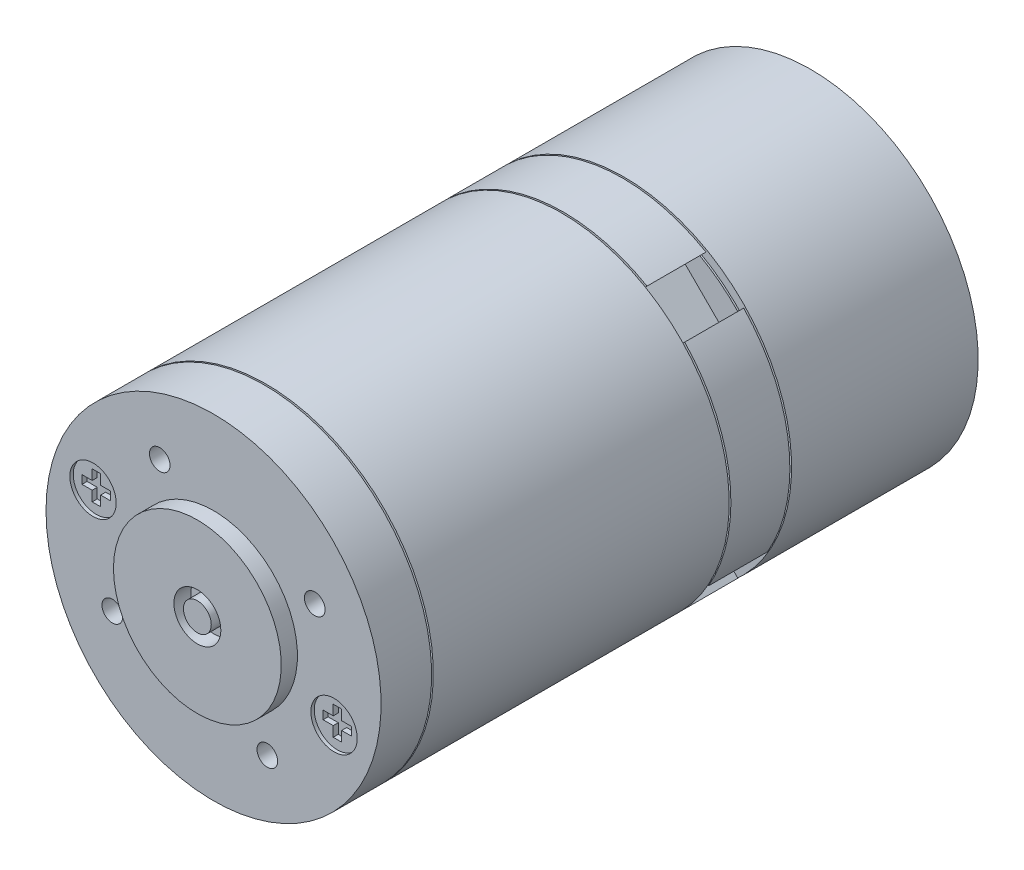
from build123d import *

# Parameters (mm, degrees)
SKETCH2_R                  = 3.7719
CUT_EXTRUDE1_DEPTH         = 6.35
SKETCH3_R                  = 3.175
BOSS_EXTRUDE1_DEPTH        = 6.35
FILLET1_R                  = 1.778
CUT_EXTRUDE2_DEPTH         = 1.27
SKETCH5_R                  = 4.953
SKETCH5_R_2                = 3.2385
CUT_EXTRUDE3_DEPTH         = 0.0254
SKETCH5_3_R                = 3.175
BOSS_EXTRUDE2_DEPTH        = 17.5006
CUT_EXTRUDE4_START         = -15.494
CUT_EXTRUDE4_DEPTH         = 15.494
SKETCH8_R                  = 3.53695
SKETCH8_R_2                = 2.0955
CUT_EXTRUDE6_DEPTH         = 2.54
SKETCH8_3_R                = 2.0955
BOSS_EXTRUDE3_DEPTH        = 5.08
SKETCH9_R                  = 1.55575
CUT_EXTRUDE7_DEPTH         = 6.35
SKETCH10_R                 = 3.4925
CUT_EXTRUDE8_DEPTH         = 0.508
SKETCH10_3_W               = 1.27
SKETCH10_3_H               = 1.524
SKETCH10_3_W_2             = 1.524
SKETCH10_3_H_2             = 1.27
SKETCH10_3_H_3             = 4.318
SKETCH10_3_W_3             = 4.318
CUT_EXTRUDE11_DEPTH        = 1.27
CUT_EXTRUDE12_DEPTH        = 8.89
F_10_32_TAPPED_HOLE1_D     = 4.0386
F_10_32_TAPPED_HOLE1_DEPTH = 24.0284
F_10_32_TAPPED_HOLE1_TIP   = 1.213317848


with BuildPart() as part:
    # Sketch1 → Revolve1 (revolve)
    with BuildSketch(Plane(origin=(0, 0, 0), x_dir=(0, 0, -1), z_dir=(1, 0, 0)), mode=Mode.PRIVATE) as revolve1_sk:
        Polygon((0, 0), (0, 12.64285), (2.4384, 12.64285), (2.4384, 25.2476), (10.0584, 25.2476), (10.0584, 23.9776), (10.3124, 23.9776), (10.3124, 25.2476), (54.9021, 25.2476), (54.9021, 23.9776), (55.1561, 23.9776), (55.1561, 25.2476), (64.0461, 25.2476), (64.0461, 23.9776), (64.3001, 23.9776), (64.3001, 25.2476), (92.4179, 25.2476), (92.4179, 14.2621), (94.0054, 14.2621), (94.0054, 0), align=None)
    revolve(revolve1_sk.sketch.rotate(Axis((0, 0, -94.0054), (0, 0, 1)), 90), axis=Axis((0, 0, -94.0054), (0, 0, 1)))

    # Sketch2 → Cut-Extrude1 (cut)
    with BuildSketch(Plane(origin=(0, 0, -92.4179), x_dir=(-1, 0, 0), z_dir=(0, 0, -1))):
        with Locations((0, 18.9865)):
            Circle(SKETCH2_R)
        with Locations((16.442791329, -9.49325)):
            Circle(SKETCH2_R)
        with Locations((-16.442791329, -9.49325)):
            Circle(SKETCH2_R)
    extrude(amount=-CUT_EXTRUDE1_DEPTH, mode=Mode.SUBTRACT)

    # Sketch3 → Boss-Extrude1 (add)
    with BuildSketch(Plane(origin=(0, 0, -89.8779), x_dir=(-1, 0, 0), z_dir=(0, 0, -1))):
        with Locations((0, 18.9865)):
            Circle(SKETCH3_R)
        with Locations((16.442791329, -9.49325)):
            Circle(SKETCH3_R)
        with Locations((-16.442791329, -9.49325)):
            Circle(SKETCH3_R)
    extrude(amount=-BOSS_EXTRUDE1_DEPTH)

    # Fillet1
    fillet1_edges = [part.edges().sort_by_distance(p)[0] for p in [
        (3.175, 18.9865, -89.8779),
        (-13.267791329, -9.49325, -89.8779),
        (19.617791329, -9.49325, -89.8779),
    ]]
    fillet(fillet1_edges, radius=FILLET1_R)

    # Sketch4 → Cut-Extrude2 (cut)
    with BuildSketch(Plane(origin=(0, 0, -89.8779), x_dir=(-1, 0, 0), z_dir=(0, 0, -1))):
        Polygon((0, 20.452969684), (-1.27, 19.719734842), (-1.27, 18.253265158), (0, 17.520030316), (1.27, 18.253265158), (1.27, 19.719734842), align=None)
        Polygon((16.442791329, -10.959719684), (17.712791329, -10.226484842), (17.712791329, -8.760015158), (16.442791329, -8.026780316), (15.172791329, -8.760015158), (15.172791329, -10.226484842), align=None)
        Polygon((-17.712791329, -8.760015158), (-17.712791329, -10.226484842), (-16.442791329, -10.959719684), (-15.172791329, -10.226484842), (-15.172791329, -8.760015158), (-16.442791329, -8.026780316), align=None)
    extrude(amount=-CUT_EXTRUDE2_DEPTH, mode=Mode.SUBTRACT)

    # Sketch5 → Cut-Extrude3 (cut)
    with BuildSketch(Plane(origin=(0, 0, -94.0054), x_dir=(-1, 0, 0), z_dir=(0, 0, -1))):
        with Locations((0, -8.3693)):
            Circle(SKETCH5_R)
        with Locations((0, -8.3693)):
            Circle(SKETCH5_R_2, mode=Mode.SUBTRACT)
    extrude(amount=-CUT_EXTRUDE3_DEPTH, mode=Mode.SUBTRACT)

    # Sketch5_3 → Boss-Extrude2 (add)
    with BuildSketch(Plane(origin=(0, 0, -94.0054), x_dir=(-1, 0, 0), z_dir=(0, 0, -1))):
        with Locations((0, -8.3693)):
            Circle(SKETCH5_3_R)
    extrude(amount=BOSS_EXTRUDE2_DEPTH)

    # Sketch6 → Cut-Extrude4 (cut)
    with BuildSketch(Plane(origin=(0, 0, -111.506), x_dir=(-1, 0, 0), z_dir=(0, 0, -1)).offset(CUT_EXTRUDE4_START)):
        with BuildLine():
            Line((-2.063505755, -5.9563), (2.063505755, -5.9563))
            ThreePointArc((2.063505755, -5.9563), (0, -5.1943), (-2.063505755, -5.9563))
        make_face()
    extrude(amount=CUT_EXTRUDE4_DEPTH, mode=Mode.SUBTRACT)

    # Sketch8 → Cut-Extrude6 (cut)
    # profile 1 of 2: a face of its own
    with BuildSketch(Plane.XY):
        Circle(SKETCH8_R)
        Circle(SKETCH8_R_2, mode=Mode.SUBTRACT)
    # profile 2 of 2: a face of its own
    with BuildSketch(Plane.XY):
        Circle(SKETCH8_R_2)
    extrude(amount=-CUT_EXTRUDE6_DEPTH, mode=Mode.SUBTRACT)

    # Sketch8_3 → Boss-Extrude3 (add)
    with BuildSketch(Plane.XY):
        Circle(SKETCH8_3_R)
    extrude(amount=-BOSS_EXTRUDE3_DEPTH)

    # Sketch9 → Cut-Extrude7 (cut)
    with BuildSketch(Plane.XY.offset(-2.4384)):
        with Locations((15.252477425, 8.104177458)):
            Circle(SKETCH9_R)
        with Locations((8.104177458, -15.252477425)):
            Circle(SKETCH9_R)
        with Locations((-15.252477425, -8.104177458)):
            Circle(SKETCH9_R)
        with Locations((-8.104177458, 15.252477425)):
            Circle(SKETCH9_R)
    extrude(amount=-CUT_EXTRUDE7_DEPTH, mode=Mode.SUBTRACT)

    # Sketch10 → Cut-Extrude8 (cut)
    with BuildSketch(Plane.XY.offset(-2.4384)):
        with Locations((-18.15997441, 6.279760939)):
            Circle(SKETCH10_R)
        with Locations((18.15997441, -6.279760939)):
            Circle(SKETCH10_R)
    extrude(amount=-CUT_EXTRUDE8_DEPTH, mode=Mode.SUBTRACT)

    # Sketch10_3 → Cut-Extrude11 (cut)
    with BuildSketch(Plane.XY.offset(-2.4384)):
        with Locations((18.15997441, -7.676760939)):
            Rectangle(SKETCH10_3_W, SKETCH10_3_H)
        with Locations((19.55697441, -6.279760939)):
            Rectangle(SKETCH10_3_W_2, SKETCH10_3_H_2)
        with Locations((18.15997441, -6.279760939)):
            Rectangle(SKETCH10_3_W, SKETCH10_3_H_2)
        with Locations((16.76297441, -6.279760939)):
            Rectangle(SKETCH10_3_W_2, SKETCH10_3_H_2)
        with Locations((18.15997441, -4.882760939)):
            Rectangle(SKETCH10_3_W, SKETCH10_3_H)
        with Locations((-18.15997441, 6.279760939)):
            Rectangle(SKETCH10_3_W, SKETCH10_3_H_3)
        with Locations((-18.15997441, 6.279760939)):
            Rectangle(SKETCH10_3_W_3, SKETCH10_3_H_2)
    extrude(amount=-CUT_EXTRUDE11_DEPTH, mode=Mode.SUBTRACT)

    # Sketch11 → Cut-Extrude12 (cut)
    with BuildSketch(Plane(origin=(0, 0, -64.0461), x_dir=(-1, 0, 0), z_dir=(0, 0, -1))):
        Polygon((17.866182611, 18.747137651), (13.663422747, 14.544377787), (18.737267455, 9.470533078), (22.94002732, 13.673292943), align=None)
        Polygon((14.544377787, -13.663422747), (9.470533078, -18.737267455), (13.673292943, -22.94002732), (18.747137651, -17.866182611), align=None)
        Polygon((-13.663422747, -14.544377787), (-18.737267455, -9.470533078), (-22.94002732, -13.673292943), (-17.866182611, -18.747137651), align=None)
        Polygon((-14.544377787, 13.663422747), (-9.470533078, 18.737267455), (-13.673292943, 22.94002732), (-18.747137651, 17.866182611), align=None)
    extrude(amount=-CUT_EXTRUDE12_DEPTH, mode=Mode.SUBTRACT)

    # 10-32 Tapped Hole1
    with Locations(Plane(origin=(0, 0, -92.4179), x_dir=(-1, 0, 0), z_dir=(0, 0, -1))):
        with Locations((19.08175, 0), (-19.08175, 0)):
            Hole(F_10_32_TAPPED_HOLE1_D / 2, depth=F_10_32_TAPPED_HOLE1_DEPTH)
            with Locations((0, 0, -(F_10_32_TAPPED_HOLE1_DEPTH + F_10_32_TAPPED_HOLE1_TIP / 2))):  # 118° drill point
                Cone(0, F_10_32_TAPPED_HOLE1_D / 2, F_10_32_TAPPED_HOLE1_TIP, mode=Mode.SUBTRACT)


solid = part.part
